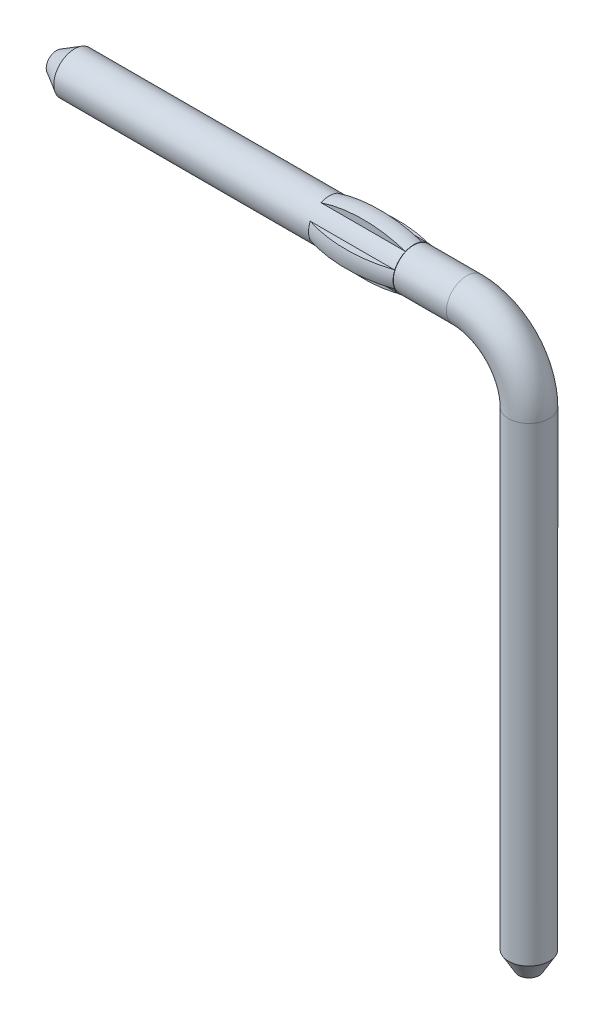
ISO-10303-21;
HEADER;
FILE_DESCRIPTION(('STEP AP214'),'2;1');
FILE_NAME('part.step','',(''),(''),'','','');
FILE_SCHEMA(('AUTOMOTIVE_DESIGN { 1 0 10303 214 1 1 1 1 }'));
ENDSEC;
DATA;
#1=APPLICATION_CONTEXT('core data for automotive mechanical design processes');
#2=APPLICATION_PROTOCOL_DEFINITION('international standard','automotive_design',2000,#1);
#3=PRODUCT_CONTEXT('',#1,'mechanical');
#4=PRODUCT('Part','Part','',(#3));
#5=PRODUCT_RELATED_PRODUCT_CATEGORY('part','',(#4));
#6=PRODUCT_DEFINITION_FORMATION('','',#4);
#7=PRODUCT_DEFINITION_CONTEXT('part definition',#1,'design');
#8=PRODUCT_DEFINITION('design','',#6,#7);
#9=PRODUCT_DEFINITION_SHAPE('','',#8);
#10=(LENGTH_UNIT() NAMED_UNIT(*) SI_UNIT(.MILLI.,.METRE.));
#11=(NAMED_UNIT(*) PLANE_ANGLE_UNIT() SI_UNIT($,.RADIAN.));
#12=(NAMED_UNIT(*) SI_UNIT($,.STERADIAN.) SOLID_ANGLE_UNIT());
#13=UNCERTAINTY_MEASURE_WITH_UNIT(LENGTH_MEASURE(1.E-05),#10,'distance_accuracy_value','');
#14=(GEOMETRIC_REPRESENTATION_CONTEXT(3) GLOBAL_UNCERTAINTY_ASSIGNED_CONTEXT((#13)) GLOBAL_UNIT_ASSIGNED_CONTEXT((#10,
#11,#12)) REPRESENTATION_CONTEXT('',''));
#15=CARTESIAN_POINT('',(0.,0.,0.));
#16=DIRECTION('',(0.,0.,1.));
#17=DIRECTION('',(1.,0.,0.));
#18=AXIS2_PLACEMENT_3D('',#15,#16,#17);
#19=CARTESIAN_POINT('',(-5.7,0.,0.));
#20=DIRECTION('',(1.,0.,0.));
#21=DIRECTION('',(0.,0.,-1.));
#22=AXIS2_PLACEMENT_3D('',#19,#20,#21);
#23=PLANE('',#22);
#24=CARTESIAN_POINT('',(-5.69999999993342,0.,0.));
#25=DIRECTION('',(1.,0.,0.));
#26=DIRECTION('',(0.,0.,-1.));
#27=AXIS2_PLACEMENT_3D('',#24,#25,#26);
#28=CIRCLE('',#27,0.12499999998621);
#29=CARTESIAN_POINT('',(-5.69999999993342,0.,-0.12499999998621));
#30=VERTEX_POINT('',#29);
#31=EDGE_CURVE('E21',#30,#30,#28,.T.);
#32=ORIENTED_EDGE('',*,*,#31,.F.);
#33=EDGE_LOOP('',(#32));
#34=FACE_BOUND('',#33,.T.);
#35=ADVANCED_FACE('F16',(#34),#23,.F.);
#36=CARTESIAN_POINT('',(-5.7,0.1,0.2291287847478));
#37=DIRECTION('',(0.,-1.,0.));
#38=DIRECTION('',(0.,0.,-1.));
#39=AXIS2_PLACEMENT_3D('',#36,#37,#38);
#40=PLANE('',#39);
#41=CARTESIAN_POINT('',(-1.39000000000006,0.1,0.229128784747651));
#42=CARTESIAN_POINT('',(-1.42100227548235,0.1,0.239288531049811));
#43=CARTESIAN_POINT('',(-1.45232127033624,0.1,0.248453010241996));
#44=CARTESIAN_POINT('',(-1.51545487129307,0.1,0.264830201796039));
#45=CARTESIAN_POINT('',(-1.54726930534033,0.1,0.272043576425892));
#46=CARTESIAN_POINT('',(-1.6435182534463,0.1,0.290870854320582));
#47=CARTESIAN_POINT('',(-1.7085269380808,0.1,0.299597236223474));
#48=CARTESIAN_POINT('',(-1.86808650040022,0.1,0.311579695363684));
#49=CARTESIAN_POINT('',(-1.96298668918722,0.1,0.310709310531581));
#50=CARTESIAN_POINT('',(-2.10398407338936,0.1,0.297494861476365));
#51=CARTESIAN_POINT('',(-2.15072624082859,0.1,0.29111365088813));
#52=CARTESIAN_POINT('',(-2.24348691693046,0.1,0.274376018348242));
#53=CARTESIAN_POINT('',(-2.28950587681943,0.1,0.264022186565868));
#54=CARTESIAN_POINT('',(-2.3601591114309,0.1,0.244758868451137));
#55=CARTESIAN_POINT('',(-2.385185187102,0.1,0.237261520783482));
#56=CARTESIAN_POINT('',(-2.41000000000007,0.1,0.22912878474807));
#57=B_SPLINE_CURVE_WITH_KNOTS('',3,(#41,#42,#43,#44,#45,#46,#47,#48,#49,#50,#51,#52,#53,#54,#55,
#56),.UNSPECIFIED.,.F.,.F.,(4,2,2,2,2,2,2,4),(0.,0.0978417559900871,0.19565025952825,
0.391991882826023,0.675172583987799,0.816569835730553,0.957875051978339,1.03621668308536),.UNSPECIFIED.);
#58=CARTESIAN_POINT('',(-1.39,0.0999999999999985,0.229128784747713));
#59=VERTEX_POINT('',#58);
#60=CARTESIAN_POINT('',(-2.40999999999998,0.0999999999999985,0.229128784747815));
#61=VERTEX_POINT('',#60);
#62=EDGE_CURVE('E118',#59,#61,#57,.T.);
#63=ORIENTED_EDGE('',*,*,#62,.F.);
#64=DIRECTION('',(1.,0.,0.));
#65=VECTOR('',#64,1.);
#66=CARTESIAN_POINT('',(-5.7,0.099999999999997,0.229128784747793));
#67=LINE('',#66,#65);
#68=EDGE_CURVE('E91',#61,#59,#67,.T.);
#69=ORIENTED_EDGE('',*,*,#68,.F.);
#70=EDGE_LOOP('',(#63,#69));
#71=FACE_BOUND('',#70,.T.);
#72=ADVANCED_FACE('F129',(#71),#40,.F.);
#73=CARTESIAN_POINT('',(-5.7,-0.1,0.2291287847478));
#74=DIRECTION('',(0.,-1.,0.));
#75=DIRECTION('',(0.,0.,-1.));
#76=AXIS2_PLACEMENT_3D('',#73,#74,#75);
#77=PLANE('',#76);
#78=DIRECTION('',(1.,0.,0.));
#79=VECTOR('',#78,1.);
#80=CARTESIAN_POINT('',(-5.7,-0.099999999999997,0.229128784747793));
#81=LINE('',#80,#79);
#82=CARTESIAN_POINT('',(-1.39,-0.0999999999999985,0.229128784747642));
#83=VERTEX_POINT('',#82);
#84=CARTESIAN_POINT('',(-2.40999999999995,-0.0999999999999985,0.229128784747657));
#85=VERTEX_POINT('',#84);
#86=EDGE_CURVE('E84',#83,#85,#81,.F.);
#87=ORIENTED_EDGE('',*,*,#86,.F.);
#88=CARTESIAN_POINT('',(-2.40999999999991,-0.1,0.22912878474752));
#89=CARTESIAN_POINT('',(-2.37899772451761,-0.1,0.239288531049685));
#90=CARTESIAN_POINT('',(-2.34767872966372,-0.1,0.248453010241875));
#91=CARTESIAN_POINT('',(-2.28454512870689,-0.1,0.264830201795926));
#92=CARTESIAN_POINT('',(-2.25273069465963,-0.1,0.272043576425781));
#93=CARTESIAN_POINT('',(-2.15648174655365,-0.1,0.290870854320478));
#94=CARTESIAN_POINT('',(-2.09147306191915,-0.1,0.299597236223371));
#95=CARTESIAN_POINT('',(-1.93191349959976,-0.1,0.311579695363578));
#96=CARTESIAN_POINT('',(-1.8370133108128,-0.1,0.310709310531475));
#97=CARTESIAN_POINT('',(-1.6960159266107,-0.1,0.297494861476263));
#98=CARTESIAN_POINT('',(-1.6492737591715,-0.1,0.29111365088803));
#99=CARTESIAN_POINT('',(-1.55651308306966,-0.1,0.274376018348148));
#100=CARTESIAN_POINT('',(-1.51049412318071,-0.1,0.264022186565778));
#101=CARTESIAN_POINT('',(-1.43984088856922,-0.1,0.244758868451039));
#102=CARTESIAN_POINT('',(-1.41481481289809,-0.1,0.237261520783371));
#103=CARTESIAN_POINT('',(-1.38999999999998,-0.1,0.229128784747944));
#104=B_SPLINE_CURVE_WITH_KNOTS('',3,(#88,#89,#90,#91,#92,#93,#94,#95,#96,#97,#98,#99,#100,#101,
#102,#103),.UNSPECIFIED.,.F.,.F.,(4,2,2,2,2,2,2,4),(0.,0.097841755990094,0.195650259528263,
0.391991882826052,0.675172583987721,0.816569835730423,0.957875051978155,1.03621668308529),.UNSPECIFIED.);
#105=EDGE_CURVE('E87',#85,#83,#104,.T.);
#106=ORIENTED_EDGE('',*,*,#105,.F.);
#107=EDGE_LOOP('',(#87,#106));
#108=FACE_BOUND('',#107,.T.);
#109=ADVANCED_FACE('F85',(#108),#77,.T.);
#110=CARTESIAN_POINT('',(-5.7,-0.3092329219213,0.1));
#111=DIRECTION('',(0.,0.,1.));
#112=DIRECTION('',(1.,0.,0.));
#113=AXIS2_PLACEMENT_3D('',#110,#111,#112);
#114=PLANE('',#113);
#115=DIRECTION('',(1.,0.,0.));
#116=VECTOR('',#115,1.);
#117=CARTESIAN_POINT('',(-5.7,-0.229128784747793,0.0999999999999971));
#118=LINE('',#117,#116);
#119=CARTESIAN_POINT('',(-2.40999999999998,-0.229128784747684,0.0999999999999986));
#120=VERTEX_POINT('',#119);
#121=CARTESIAN_POINT('',(-1.39,-0.229128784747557,0.0999999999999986));
#122=VERTEX_POINT('',#121);
#123=EDGE_CURVE('E113',#120,#122,#118,.T.);
#124=ORIENTED_EDGE('',*,*,#123,.F.);
#125=CARTESIAN_POINT('',(-1.39000000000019,-0.229128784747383,0.1));
#126=CARTESIAN_POINT('',(-1.4210022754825,-0.239288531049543,0.1));
#127=CARTESIAN_POINT('',(-1.45232127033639,-0.248453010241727,0.1));
#128=CARTESIAN_POINT('',(-1.51545487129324,-0.264830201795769,0.1));
#129=CARTESIAN_POINT('',(-1.5472693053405,-0.272043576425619,0.1));
#130=CARTESIAN_POINT('',(-1.6435182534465,-0.290870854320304,0.1));
#131=CARTESIAN_POINT('',(-1.70852693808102,-0.29959723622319,0.1));
#132=CARTESIAN_POINT('',(-1.86808650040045,-0.31157969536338,0.1));
#133=CARTESIAN_POINT('',(-1.96298668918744,-0.310709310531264,0.1));
#134=CARTESIAN_POINT('',(-2.10398407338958,-0.29749486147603,0.1));
#135=CARTESIAN_POINT('',(-2.1507262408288,-0.291113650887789,0.1));
#136=CARTESIAN_POINT('',(-2.24348691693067,-0.274376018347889,0.1));
#137=CARTESIAN_POINT('',(-2.28950587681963,-0.264022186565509,0.1));
#138=CARTESIAN_POINT('',(-2.360159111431,-0.244758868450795,0.1));
#139=CARTESIAN_POINT('',(-2.385185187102,-0.237261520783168,0.1));
#140=CARTESIAN_POINT('',(-2.40999999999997,-0.229128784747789,0.1));
#141=B_SPLINE_CURVE_WITH_KNOTS('',3,(#125,#126,#127,#128,#129,#130,#131,#132,#133,#134,#135,
#136,#137,#138,#139,#140),.UNSPECIFIED.,.F.,.F.,(4,2,2,2,2,2,2,4),(0.,0.0978417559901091,
0.195650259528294,0.391991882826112,0.675172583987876,0.816569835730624,0.957875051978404,
1.03621668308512),.UNSPECIFIED.);
#142=EDGE_CURVE('E107',#122,#120,#141,.T.);
#143=ORIENTED_EDGE('',*,*,#142,.F.);
#144=EDGE_LOOP('',(#124,#143));
#145=FACE_BOUND('',#144,.T.);
#146=ADVANCED_FACE('F156',(#145),#114,.T.);
#147=CARTESIAN_POINT('',(-5.7,-0.3092329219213,-0.1));
#148=DIRECTION('',(0.,0.,1.));
#149=DIRECTION('',(1.,0.,0.));
#150=AXIS2_PLACEMENT_3D('',#147,#148,#149);
#151=PLANE('',#150);
#152=CARTESIAN_POINT('',(-2.40999999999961,-0.229128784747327,-0.1));
#153=CARTESIAN_POINT('',(-2.3789977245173,-0.23928853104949,-0.1));
#154=CARTESIAN_POINT('',(-2.34767872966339,-0.248453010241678,-0.1));
#155=CARTESIAN_POINT('',(-2.28454512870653,-0.264830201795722,-0.1));
#156=CARTESIAN_POINT('',(-2.25273069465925,-0.272043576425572,-0.1));
#157=CARTESIAN_POINT('',(-2.15648174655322,-0.290870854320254,-0.1));
#158=CARTESIAN_POINT('',(-2.09147306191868,-0.299597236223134,-0.1));
#159=CARTESIAN_POINT('',(-1.93191349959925,-0.311579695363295,-0.1));
#160=CARTESIAN_POINT('',(-1.83701331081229,-0.310709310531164,-0.1));
#161=CARTESIAN_POINT('',(-1.6960159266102,-0.29749486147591,-0.1));
#162=CARTESIAN_POINT('',(-1.649273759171,-0.291113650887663,-0.1));
#163=CARTESIAN_POINT('',(-1.55651308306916,-0.274376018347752,-0.1));
#164=CARTESIAN_POINT('',(-1.51049412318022,-0.264022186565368,-0.1));
#165=CARTESIAN_POINT('',(-1.43984088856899,-0.244758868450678,-0.1));
#166=CARTESIAN_POINT('',(-1.41481481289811,-0.237261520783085,-0.1));
#167=CARTESIAN_POINT('',(-1.39000000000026,-0.229128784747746,-0.1));
#168=B_SPLINE_CURVE_WITH_KNOTS('',3,(#152,#153,#154,#155,#156,#157,#158,#159,#160,#161,#162,
#163,#164,#165,#166,#167),.UNSPECIFIED.,.F.,.F.,(4,2,2,2,2,2,2,4),(0.,0.0978417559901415,
0.195650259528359,0.391991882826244,0.675172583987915,0.816569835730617,0.957875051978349,
1.03621668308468),.UNSPECIFIED.);
#169=CARTESIAN_POINT('',(-2.40999999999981,-0.22912878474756,-0.0999999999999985));
#170=VERTEX_POINT('',#169);
#171=CARTESIAN_POINT('',(-1.39000000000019,-0.229128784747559,-0.0999999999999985));
#172=VERTEX_POINT('',#171);
#173=EDGE_CURVE('E145',#170,#172,#168,.T.);
#174=ORIENTED_EDGE('',*,*,#173,.F.);
#175=DIRECTION('',(1.,0.,0.));
#176=VECTOR('',#175,1.);
#177=CARTESIAN_POINT('',(-5.7,-0.229128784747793,-0.0999999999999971));
#178=LINE('',#177,#176);
#179=EDGE_CURVE('E216',#172,#170,#178,.F.);
#180=ORIENTED_EDGE('',*,*,#179,.F.);
#181=EDGE_LOOP('',(#174,#180));
#182=FACE_BOUND('',#181,.T.);
#183=ADVANCED_FACE('F159',(#182),#151,.F.);
#184=CARTESIAN_POINT('',(-5.48349364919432,0.,0.));
#185=DIRECTION('',(1.,0.,0.));
#186=DIRECTION('',(0.,0.,-1.));
#187=AXIS2_PLACEMENT_3D('',#184,#185,#186);
#188=CONICAL_SURFACE('',#187,0.249999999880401,0.523598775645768);
#189=CARTESIAN_POINT('',(-5.483493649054,0.,0.));
#190=DIRECTION('',(1.,0.,0.));
#191=DIRECTION('',(0.,0.,-1.));
#192=AXIS2_PLACEMENT_3D('',#189,#190,#191);
#193=CIRCLE('',#192,0.25);
#194=CARTESIAN_POINT('',(-5.483493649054,0.,-0.25));
#195=VERTEX_POINT('',#194);
#196=EDGE_CURVE('E210',#195,#195,#193,.T.);
#197=ORIENTED_EDGE('',*,*,#196,.F.);
#198=EDGE_LOOP('',(#197));
#199=FACE_BOUND('',#198,.T.);
#200=ORIENTED_EDGE('',*,*,#31,.T.);
#201=EDGE_LOOP('',(#200));
#202=FACE_BOUND('',#201,.T.);
#203=ADVANCED_FACE('F296',(#199,#202),#188,.T.);
#204=CARTESIAN_POINT('',(-5.7,0.1,-0.2291287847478));
#205=DIRECTION('',(0.,1.,0.));
#206=DIRECTION('',(0.,0.,1.));
#207=AXIS2_PLACEMENT_3D('',#204,#205,#206);
#208=PLANE('',#207);
#209=DIRECTION('',(1.,0.,0.));
#210=VECTOR('',#209,1.);
#211=CARTESIAN_POINT('',(-5.7,0.0999999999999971,-0.229128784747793));
#212=LINE('',#211,#210);
#213=CARTESIAN_POINT('',(-1.39000000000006,0.0999999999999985,-0.229128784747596));
#214=VERTEX_POINT('',#213);
#215=CARTESIAN_POINT('',(-2.40999999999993,0.0999999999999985,-0.229128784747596));
#216=VERTEX_POINT('',#215);
#217=EDGE_CURVE('E209',#214,#216,#212,.F.);
#218=ORIENTED_EDGE('',*,*,#217,.F.);
#219=CARTESIAN_POINT('',(-2.40999999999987,0.1,-0.229128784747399));
#220=CARTESIAN_POINT('',(-2.37899772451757,0.1,-0.239288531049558));
#221=CARTESIAN_POINT('',(-2.34767872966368,0.1,-0.248453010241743));
#222=CARTESIAN_POINT('',(-2.28454512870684,0.1,-0.264830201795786));
#223=CARTESIAN_POINT('',(-2.25273069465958,0.1,-0.272043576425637));
#224=CARTESIAN_POINT('',(-2.15648174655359,0.1,-0.290870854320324));
#225=CARTESIAN_POINT('',(-2.09147306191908,0.1,-0.299597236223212));
#226=CARTESIAN_POINT('',(-1.93191349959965,0.1,-0.311579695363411));
#227=CARTESIAN_POINT('',(-1.83701331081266,0.1,-0.310709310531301));
#228=CARTESIAN_POINT('',(-1.69601592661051,0.1,-0.297494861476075));
#229=CARTESIAN_POINT('',(-1.64927375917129,0.1,-0.291113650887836));
#230=CARTESIAN_POINT('',(-1.55651308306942,0.1,-0.274376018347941));
#231=CARTESIAN_POINT('',(-1.51049412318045,0.1,-0.264022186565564));
#232=CARTESIAN_POINT('',(-1.43984088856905,0.1,-0.244758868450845));
#233=CARTESIAN_POINT('',(-1.41481481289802,0.1,-0.23726152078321));
#234=CARTESIAN_POINT('',(-1.39000000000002,0.1,-0.229128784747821));
#235=B_SPLINE_CURVE_WITH_KNOTS('',3,(#219,#220,#221,#222,#223,#224,#225,#226,#227,#228,#229,
#230,#231,#232,#233,#234),.UNSPECIFIED.,.F.,.F.,(4,2,2,2,2,2,2,4),(0.,0.097841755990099,
0.195650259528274,0.391991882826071,0.675172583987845,0.816569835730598,0.957875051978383,
1.0362166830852),.UNSPECIFIED.);
#236=EDGE_CURVE('E220',#216,#214,#235,.T.);
#237=ORIENTED_EDGE('',*,*,#236,.F.);
#238=EDGE_LOOP('',(#218,#237));
#239=FACE_BOUND('',#238,.T.);
#240=ADVANCED_FACE('F271',(#239),#208,.T.);
#241=CARTESIAN_POINT('',(-5.7,-0.1,-0.2291287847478));
#242=DIRECTION('',(0.,1.,0.));
#243=DIRECTION('',(0.,0.,1.));
#244=AXIS2_PLACEMENT_3D('',#241,#242,#243);
#245=PLANE('',#244);
#246=CARTESIAN_POINT('',(-1.3900000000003,-0.1,-0.229128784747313));
#247=CARTESIAN_POINT('',(-1.42100227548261,-0.1,-0.239288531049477));
#248=CARTESIAN_POINT('',(-1.45232127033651,-0.1,-0.248453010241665));
#249=CARTESIAN_POINT('',(-1.51545487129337,-0.1,-0.264830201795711));
#250=CARTESIAN_POINT('',(-1.54726930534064,-0.1,-0.272043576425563));
#251=CARTESIAN_POINT('',(-1.64351825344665,-0.1,-0.29087085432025));
#252=CARTESIAN_POINT('',(-1.70852693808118,-0.1,-0.299597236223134));
#253=CARTESIAN_POINT('',(-1.8680865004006,-0.1,-0.311579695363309));
#254=CARTESIAN_POINT('',(-1.96298668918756,-0.1,-0.310709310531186));
#255=CARTESIAN_POINT('',(-2.10398407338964,-0.1,-0.297494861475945));
#256=CARTESIAN_POINT('',(-2.15072624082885,-0.1,-0.291113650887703));
#257=CARTESIAN_POINT('',(-2.24348691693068,-0.1,-0.274376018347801));
#258=CARTESIAN_POINT('',(-2.28950587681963,-0.1,-0.264022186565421));
#259=CARTESIAN_POINT('',(-2.36015911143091,-0.1,-0.244758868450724));
#260=CARTESIAN_POINT('',(-2.38518518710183,-0.1,-0.237261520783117));
#261=CARTESIAN_POINT('',(-2.40999999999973,-0.1,-0.229128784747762));
#262=B_SPLINE_CURVE_WITH_KNOTS('',3,(#246,#247,#248,#249,#250,#251,#252,#253,#254,#255,#256,
#257,#258,#259,#260,#261),.UNSPECIFIED.,.F.,.F.,(4,2,2,2,2,2,2,4),(0.,0.0978417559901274,
0.19565025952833,0.391991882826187,0.675172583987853,0.816569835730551,0.957875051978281,
1.03621668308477),.UNSPECIFIED.);
#263=CARTESIAN_POINT('',(-1.39000000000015,-0.0999999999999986,-0.229128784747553));
#264=VERTEX_POINT('',#263);
#265=CARTESIAN_POINT('',(-2.40999999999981,-0.0999999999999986,-0.229128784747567));
#266=VERTEX_POINT('',#265);
#267=EDGE_CURVE('E274',#264,#266,#262,.T.);
#268=ORIENTED_EDGE('',*,*,#267,.F.);
#269=DIRECTION('',(1.,0.,0.));
#270=VECTOR('',#269,1.);
#271=CARTESIAN_POINT('',(-5.7,-0.0999999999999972,-0.229128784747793));
#272=LINE('',#271,#270);
#273=EDGE_CURVE('E214',#266,#264,#272,.T.);
#274=ORIENTED_EDGE('',*,*,#273,.F.);
#275=EDGE_LOOP('',(#268,#274));
#276=FACE_BOUND('',#275,.T.);
#277=ADVANCED_FACE('F267',(#276),#245,.F.);
#278=CARTESIAN_POINT('',(-5.7,0.3092329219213,-0.1));
#279=DIRECTION('',(0.,0.,-1.));
#280=DIRECTION('',(-1.,0.,0.));
#281=AXIS2_PLACEMENT_3D('',#278,#279,#280);
#282=PLANE('',#281);
#283=DIRECTION('',(1.,0.,0.));
#284=VECTOR('',#283,1.);
#285=CARTESIAN_POINT('',(-5.7,0.229128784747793,-0.0999999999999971));
#286=LINE('',#285,#284);
#287=CARTESIAN_POINT('',(-2.40999999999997,0.229128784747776,-0.0999999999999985));
#288=VERTEX_POINT('',#287);
#289=CARTESIAN_POINT('',(-1.39000000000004,0.229128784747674,-0.0999999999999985));
#290=VERTEX_POINT('',#289);
#291=EDGE_CURVE('E207',#288,#290,#286,.T.);
#292=ORIENTED_EDGE('',*,*,#291,.F.);
#293=CARTESIAN_POINT('',(-1.39000000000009,0.229128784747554,-0.1));
#294=CARTESIAN_POINT('',(-1.42100227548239,0.239288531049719,-0.1));
#295=CARTESIAN_POINT('',(-1.45232127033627,0.248453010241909,-0.1));
#296=CARTESIAN_POINT('',(-1.51545487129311,0.264830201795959,-0.1));
#297=CARTESIAN_POINT('',(-1.54726930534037,0.272043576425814,-0.1));
#298=CARTESIAN_POINT('',(-1.64351825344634,0.290870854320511,-0.1));
#299=CARTESIAN_POINT('',(-1.70852693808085,0.299597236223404,-0.1));
#300=CARTESIAN_POINT('',(-1.86808650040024,0.311579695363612,-0.1));
#301=CARTESIAN_POINT('',(-1.9629866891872,0.310709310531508,-0.1));
#302=CARTESIAN_POINT('',(-2.1039840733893,0.297494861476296,-0.1));
#303=CARTESIAN_POINT('',(-2.15072624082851,0.291113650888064,-0.1));
#304=CARTESIAN_POINT('',(-2.24348691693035,0.274376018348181,-0.1));
#305=CARTESIAN_POINT('',(-2.2895058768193,0.26402218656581,-0.1));
#306=CARTESIAN_POINT('',(-2.3601591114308,0.244758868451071,-0.1));
#307=CARTESIAN_POINT('',(-2.38518518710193,0.237261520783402,-0.1));
#308=CARTESIAN_POINT('',(-2.41000000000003,0.229128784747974,-0.1));
#309=B_SPLINE_CURVE_WITH_KNOTS('',3,(#293,#294,#295,#296,#297,#298,#299,#300,#301,#302,#303,
#304,#305,#306,#307,#308),.UNSPECIFIED.,.F.,.F.,(4,2,2,2,2,2,2,4),(0.,0.0978417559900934,
0.195650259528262,0.391991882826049,0.675172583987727,0.816569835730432,0.957875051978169,
1.03621668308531),.UNSPECIFIED.);
#310=EDGE_CURVE('E35',#290,#288,#309,.T.);
#311=ORIENTED_EDGE('',*,*,#310,.F.);
#312=EDGE_LOOP('',(#292,#311));
#313=FACE_BOUND('',#312,.T.);
#314=ADVANCED_FACE('F262',(#313),#282,.T.);
#315=CARTESIAN_POINT('',(-5.7,0.3092329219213,0.1));
#316=DIRECTION('',(0.,0.,-1.));
#317=DIRECTION('',(-1.,0.,0.));
#318=AXIS2_PLACEMENT_3D('',#315,#316,#317);
#319=PLANE('',#318);
#320=CARTESIAN_POINT('',(-2.40999999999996,0.229128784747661,0.1));
#321=CARTESIAN_POINT('',(-2.37899772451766,0.239288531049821,0.1));
#322=CARTESIAN_POINT('',(-2.34767872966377,0.248453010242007,0.1));
#323=CARTESIAN_POINT('',(-2.28454512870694,0.264830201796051,0.1));
#324=CARTESIAN_POINT('',(-2.25273069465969,0.272043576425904,0.1));
#325=CARTESIAN_POINT('',(-2.15648174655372,0.290870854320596,0.1));
#326=CARTESIAN_POINT('',(-2.09147306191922,0.299597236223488,0.1));
#327=CARTESIAN_POINT('',(-1.9319134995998,0.311579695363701,0.1));
#328=CARTESIAN_POINT('',(-1.83701331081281,0.310709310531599,0.1));
#329=CARTESIAN_POINT('',(-1.69601592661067,0.297494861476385,0.1));
#330=CARTESIAN_POINT('',(-1.64927375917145,0.291113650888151,0.1));
#331=CARTESIAN_POINT('',(-1.55651308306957,0.274376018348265,0.1));
#332=CARTESIAN_POINT('',(-1.51049412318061,0.264022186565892,0.1));
#333=CARTESIAN_POINT('',(-1.43984088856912,0.244758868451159,0.1));
#334=CARTESIAN_POINT('',(-1.41481481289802,0.237261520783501,0.1));
#335=CARTESIAN_POINT('',(-1.38999999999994,0.229128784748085,0.1));
#336=B_SPLINE_CURVE_WITH_KNOTS('',3,(#320,#321,#322,#323,#324,#325,#326,#327,#328,#329,#330,
#331,#332,#333,#334,#335),.UNSPECIFIED.,.F.,.F.,(4,2,2,2,2,2,2,4),(0.,0.0978417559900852,
0.195650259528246,0.391991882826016,0.675172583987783,0.816569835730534,0.957875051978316,
1.03621668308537),.UNSPECIFIED.);
#337=CARTESIAN_POINT('',(-2.41,0.229128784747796,0.1));
#338=VERTEX_POINT('',#337);
#339=CARTESIAN_POINT('',(-1.39000000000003,0.229128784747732,0.1));
#340=VERTEX_POINT('',#339);
#341=EDGE_CURVE('E103',#338,#340,#336,.T.);
#342=ORIENTED_EDGE('',*,*,#341,.F.);
#343=DIRECTION('',(-1.,0.,0.));
#344=VECTOR('',#343,1.);
#345=CARTESIAN_POINT('',(-5.7,0.2291287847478,0.1));
#346=LINE('',#345,#344);
#347=EDGE_CURVE('E117',#340,#338,#346,.T.);
#348=ORIENTED_EDGE('',*,*,#347,.F.);
#349=EDGE_LOOP('',(#342,#348));
#350=FACE_BOUND('',#349,.T.);
#351=ADVANCED_FACE('F136',(#350),#319,.F.);
#352=CARTESIAN_POINT('',(-1.9,1.62847166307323E-13,1.37693675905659E-13));
#353=DIRECTION('',(1.,0.,0.));
#354=DIRECTION('',(0.,0.,-1.));
#355=AXIS2_PLACEMENT_3D('',#352,#353,#354);
#356=DEGENERATE_TOROIDAL_SURFACE('',#355,1.44649999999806,1.77149999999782,.F.);
#357=ORIENTED_EDGE('',*,*,#105,.T.);
#358=CARTESIAN_POINT('',(-1.39,1.62847166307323E-13,1.37693675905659E-13));
#359=DIRECTION('',(1.,0.,0.));
#360=DIRECTION('',(0.,0.,-1.));
#361=AXIS2_PLACEMENT_3D('',#358,#359,#360);
#362=CIRCLE('',#361,0.249999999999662);
#363=EDGE_CURVE('E94',#59,#83,#362,.T.);
#364=ORIENTED_EDGE('',*,*,#363,.F.);
#365=ORIENTED_EDGE('',*,*,#62,.T.);
#366=CARTESIAN_POINT('',(-2.40999999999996,1.39401294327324E-13,1.10588621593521E-13));
#367=DIRECTION('',(1.,0.,0.));
#368=DIRECTION('',(0.,1.,0.));
#369=AXIS2_PLACEMENT_3D('',#366,#367,#368);
#370=CIRCLE('',#369,0.249999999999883);
#371=EDGE_CURVE('E106',#61,#85,#370,.T.);
#372=ORIENTED_EDGE('',*,*,#371,.T.);
#373=EDGE_LOOP('',(#357,#364,#365,#372));
#374=FACE_BOUND('',#373,.T.);
#375=ADVANCED_FACE('F105',(#374),#356,.F.);
#376=CARTESIAN_POINT('',(-1.9,1.62847166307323E-13,1.37693675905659E-13));
#377=DIRECTION('',(1.,0.,0.));
#378=DIRECTION('',(0.,0.,-1.));
#379=AXIS2_PLACEMENT_3D('',#376,#377,#378);
#380=DEGENERATE_TOROIDAL_SURFACE('',#379,1.44649999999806,1.77149999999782,.F.);
#381=ORIENTED_EDGE('',*,*,#173,.T.);
#382=CARTESIAN_POINT('',(-1.39,1.62847166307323E-13,1.37693675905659E-13));
#383=DIRECTION('',(1.,0.,0.));
#384=DIRECTION('',(0.,0.,-1.));
#385=AXIS2_PLACEMENT_3D('',#382,#383,#384);
#386=CIRCLE('',#385,0.249999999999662);
#387=EDGE_CURVE('E102',#122,#172,#386,.T.);
#388=ORIENTED_EDGE('',*,*,#387,.F.);
#389=ORIENTED_EDGE('',*,*,#142,.T.);
#390=CARTESIAN_POINT('',(-2.41,0.,0.));
#391=DIRECTION('',(1.,0.,0.));
#392=DIRECTION('',(0.,0.,-1.));
#393=AXIS2_PLACEMENT_3D('',#390,#391,#392);
#394=CIRCLE('',#393,0.25);
#395=EDGE_CURVE('E219',#170,#120,#394,.F.);
#396=ORIENTED_EDGE('',*,*,#395,.F.);
#397=EDGE_LOOP('',(#381,#388,#389,#396));
#398=FACE_BOUND('',#397,.T.);
#399=ADVANCED_FACE('F135',(#398),#380,.F.);
#400=CARTESIAN_POINT('',(-1.9,1.62847166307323E-13,1.37693675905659E-13));
#401=DIRECTION('',(1.,0.,0.));
#402=DIRECTION('',(0.,0.,-1.));
#403=AXIS2_PLACEMENT_3D('',#400,#401,#402);
#404=DEGENERATE_TOROIDAL_SURFACE('',#403,1.44649999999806,1.77149999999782,.F.);
#405=ORIENTED_EDGE('',*,*,#236,.T.);
#406=CARTESIAN_POINT('',(-1.39000000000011,1.62847166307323E-13,1.37693675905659E-13));
#407=DIRECTION('',(1.,0.,0.));
#408=DIRECTION('',(0.,0.,-1.));
#409=AXIS2_PLACEMENT_3D('',#406,#407,#408);
#410=CIRCLE('',#409,0.249999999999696);
#411=EDGE_CURVE('E241',#264,#214,#410,.T.);
#412=ORIENTED_EDGE('',*,*,#411,.F.);
#413=ORIENTED_EDGE('',*,*,#267,.T.);
#414=CARTESIAN_POINT('',(-2.41,0.,0.));
#415=DIRECTION('',(1.,0.,0.));
#416=DIRECTION('',(0.,0.,-1.));
#417=AXIS2_PLACEMENT_3D('',#414,#415,#416);
#418=CIRCLE('',#417,0.25);
#419=EDGE_CURVE('E213',#216,#266,#418,.F.);
#420=ORIENTED_EDGE('',*,*,#419,.F.);
#421=EDGE_LOOP('',(#405,#412,#413,#420));
#422=FACE_BOUND('',#421,.T.);
#423=ADVANCED_FACE('F140',(#422),#404,.F.);
#424=CARTESIAN_POINT('',(-5.7,0.,0.));
#425=DIRECTION('',(1.,0.,0.));
#426=DIRECTION('',(0.,0.,-1.));
#427=AXIS2_PLACEMENT_3D('',#424,#425,#426);
#428=CYLINDRICAL_SURFACE('',#427,0.25);
#429=ORIENTED_EDGE('',*,*,#196,.T.);
#430=EDGE_LOOP('',(#429));
#431=FACE_BOUND('',#430,.T.);
#432=ORIENTED_EDGE('',*,*,#273,.T.);
#433=CARTESIAN_POINT('',(-1.39,0.,0.));
#434=DIRECTION('',(1.,0.,0.));
#435=DIRECTION('',(0.,0.,-1.));
#436=AXIS2_PLACEMENT_3D('',#433,#434,#435);
#437=CIRCLE('',#436,0.25);
#438=EDGE_CURVE('E244',#172,#264,#437,.T.);
#439=ORIENTED_EDGE('',*,*,#438,.F.);
#440=ORIENTED_EDGE('',*,*,#179,.T.);
#441=ORIENTED_EDGE('',*,*,#395,.T.);
#442=ORIENTED_EDGE('',*,*,#123,.T.);
#443=CARTESIAN_POINT('',(-1.39,0.,0.));
#444=DIRECTION('',(1.,0.,0.));
#445=DIRECTION('',(0.,0.,-1.));
#446=AXIS2_PLACEMENT_3D('',#443,#444,#445);
#447=CIRCLE('',#446,0.25);
#448=EDGE_CURVE('E79',#122,#83,#447,.F.);
#449=ORIENTED_EDGE('',*,*,#448,.T.);
#450=ORIENTED_EDGE('',*,*,#86,.T.);
#451=ORIENTED_EDGE('',*,*,#371,.F.);
#452=ORIENTED_EDGE('',*,*,#68,.T.);
#453=CARTESIAN_POINT('',(-1.39,0.,0.));
#454=DIRECTION('',(1.,0.,0.));
#455=DIRECTION('',(0.,0.,-1.));
#456=AXIS2_PLACEMENT_3D('',#453,#454,#455);
#457=CIRCLE('',#456,0.25);
#458=EDGE_CURVE('E98',#59,#340,#457,.F.);
#459=ORIENTED_EDGE('',*,*,#458,.T.);
#460=ORIENTED_EDGE('',*,*,#347,.T.);
#461=CARTESIAN_POINT('',(-2.40999999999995,1.38791430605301E-13,1.09816127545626E-13));
#462=DIRECTION('',(1.,0.,0.));
#463=DIRECTION('',(0.,1.,0.));
#464=AXIS2_PLACEMENT_3D('',#461,#462,#463);
#465=CIRCLE('',#464,0.249999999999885);
#466=EDGE_CURVE('E202',#288,#338,#465,.T.);
#467=ORIENTED_EDGE('',*,*,#466,.F.);
#468=ORIENTED_EDGE('',*,*,#291,.T.);
#469=CARTESIAN_POINT('',(-1.39,0.,0.));
#470=DIRECTION('',(1.,0.,0.));
#471=DIRECTION('',(0.,0.,-1.));
#472=AXIS2_PLACEMENT_3D('',#469,#470,#471);
#473=CIRCLE('',#472,0.25);
#474=EDGE_CURVE('E239',#214,#290,#473,.T.);
#475=ORIENTED_EDGE('',*,*,#474,.F.);
#476=ORIENTED_EDGE('',*,*,#217,.T.);
#477=ORIENTED_EDGE('',*,*,#419,.T.);
#478=EDGE_LOOP('',(#432,#439,#440,#441,#442,#449,#450,#451,#452,#459,#460,#467,#468,#475,#476,#477));
#479=FACE_BOUND('',#478,.T.);
#480=ADVANCED_FACE('F111',(#431,#479),#428,.T.);
#481=CARTESIAN_POINT('',(-1.9,1.62847166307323E-13,1.37693675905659E-13));
#482=DIRECTION('',(1.,0.,0.));
#483=DIRECTION('',(0.,0.,-1.));
#484=AXIS2_PLACEMENT_3D('',#481,#482,#483);
#485=DEGENERATE_TOROIDAL_SURFACE('',#484,1.44649999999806,1.77149999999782,.F.);
#486=ORIENTED_EDGE('',*,*,#341,.T.);
#487=CARTESIAN_POINT('',(-1.39,1.62847166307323E-13,1.37693675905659E-13));
#488=DIRECTION('',(1.,0.,0.));
#489=DIRECTION('',(0.,0.,-1.));
#490=AXIS2_PLACEMENT_3D('',#487,#488,#489);
#491=CIRCLE('',#490,0.249999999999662);
#492=EDGE_CURVE('E237',#290,#340,#491,.T.);
#493=ORIENTED_EDGE('',*,*,#492,.F.);
#494=ORIENTED_EDGE('',*,*,#310,.T.);
#495=ORIENTED_EDGE('',*,*,#466,.T.);
#496=EDGE_LOOP('',(#486,#493,#494,#495));
#497=FACE_BOUND('',#496,.T.);
#498=ADVANCED_FACE('F18',(#497),#485,.F.);
#499=CARTESIAN_POINT('',(-1.39,0.,0.));
#500=DIRECTION('',(1.,0.,0.));
#501=DIRECTION('',(0.,0.,-1.));
#502=AXIS2_PLACEMENT_3D('',#499,#500,#501);
#503=PLANE('',#502);
#504=CARTESIAN_POINT('',(-1.39,0.,0.));
#505=DIRECTION('',(1.,0.,0.));
#506=DIRECTION('',(0.,0.,-1.));
#507=AXIS2_PLACEMENT_3D('',#504,#505,#506);
#508=CIRCLE('',#507,0.246);
#509=CARTESIAN_POINT('',(-1.39,0.,-0.246));
#510=VERTEX_POINT('',#509);
#511=EDGE_CURVE('E201',#510,#510,#508,.T.);
#512=ORIENTED_EDGE('',*,*,#511,.F.);
#513=EDGE_LOOP('',(#512));
#514=FACE_BOUND('',#513,.T.);
#515=ORIENTED_EDGE('',*,*,#474,.T.);
#516=ORIENTED_EDGE('',*,*,#492,.T.);
#517=ORIENTED_EDGE('',*,*,#458,.F.);
#518=ORIENTED_EDGE('',*,*,#363,.T.);
#519=ORIENTED_EDGE('',*,*,#448,.F.);
#520=ORIENTED_EDGE('',*,*,#387,.T.);
#521=ORIENTED_EDGE('',*,*,#438,.T.);
#522=ORIENTED_EDGE('',*,*,#411,.T.);
#523=EDGE_LOOP('',(#515,#516,#517,#518,#519,#520,#521,#522));
#524=FACE_BOUND('',#523,.T.);
#525=ADVANCED_FACE('F96',(#514,#524),#503,.T.);
#526=CARTESIAN_POINT('',(-1.39,0.,0.));
#527=DIRECTION('',(1.,0.,0.));
#528=DIRECTION('',(0.,0.,-1.));
#529=AXIS2_PLACEMENT_3D('',#526,#527,#528);
#530=CYLINDRICAL_SURFACE('',#529,0.246);
#531=CARTESIAN_POINT('',(-0.75,0.,0.));
#532=DIRECTION('',(1.,0.,0.));
#533=DIRECTION('',(0.,1.,0.));
#534=AXIS2_PLACEMENT_3D('',#531,#532,#533);
#535=CIRCLE('',#534,0.246);
#536=CARTESIAN_POINT('',(-0.75,0.246,0.));
#537=VERTEX_POINT('',#536);
#538=EDGE_CURVE('E197',#537,#537,#535,.T.);
#539=ORIENTED_EDGE('',*,*,#538,.F.);
#540=EDGE_LOOP('',(#539));
#541=FACE_BOUND('',#540,.T.);
#542=ORIENTED_EDGE('',*,*,#511,.T.);
#543=EDGE_LOOP('',(#542));
#544=FACE_BOUND('',#543,.T.);
#545=ADVANCED_FACE('F191',(#541,#544),#530,.T.);
#546=CARTESIAN_POINT('',(-0.75,-0.75,0.));
#547=DIRECTION('',(0.,0.,-1.));
#548=DIRECTION('',(0.,-1.,0.));
#549=AXIS2_PLACEMENT_3D('',#546,#547,#548);
#550=TOROIDAL_SURFACE('',#549,0.75,0.246);
#551=CARTESIAN_POINT('',(0.,-0.75,0.));
#552=DIRECTION('',(0.,-1.,0.));
#553=DIRECTION('',(0.,0.,-1.));
#554=AXIS2_PLACEMENT_3D('',#551,#552,#553);
#555=CIRCLE('',#554,0.246);
#556=CARTESIAN_POINT('',(0.,-0.75,-0.246));
#557=VERTEX_POINT('',#556);
#558=EDGE_CURVE('E200',#557,#557,#555,.T.);
#559=ORIENTED_EDGE('',*,*,#558,.F.);
#560=EDGE_LOOP('',(#559));
#561=FACE_BOUND('',#560,.T.);
#562=ORIENTED_EDGE('',*,*,#538,.T.);
#563=EDGE_LOOP('',(#562));
#564=FACE_BOUND('',#563,.T.);
#565=ADVANCED_FACE('F186',(#561,#564),#550,.T.);
#566=CARTESIAN_POINT('',(0.,-6.63,0.));
#567=DIRECTION('',(0.,-1.,0.));
#568=DIRECTION('',(0.,0.,-1.));
#569=AXIS2_PLACEMENT_3D('',#566,#567,#568);
#570=PLANE('',#569);
#571=CARTESIAN_POINT('',(0.,-6.62999999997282,0.));
#572=DIRECTION('',(0.,1.,0.));
#573=DIRECTION('',(0.,0.,1.));
#574=AXIS2_PLACEMENT_3D('',#571,#572,#573);
#575=CIRCLE('',#574,0.124999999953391);
#576=CARTESIAN_POINT('',(0.,-6.62999999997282,0.124999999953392));
#577=VERTEX_POINT('',#576);
#578=EDGE_CURVE('E27',#577,#577,#575,.T.);
#579=ORIENTED_EDGE('',*,*,#578,.F.);
#580=EDGE_LOOP('',(#579));
#581=FACE_BOUND('',#580,.T.);
#582=ADVANCED_FACE('F178',(#581),#570,.T.);
#583=CARTESIAN_POINT('',(0.,-6.42042185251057,0.));
#584=DIRECTION('',(0.,1.,0.));
#585=DIRECTION('',(0.,0.,1.));
#586=AXIS2_PLACEMENT_3D('',#583,#584,#585);
#587=CONICAL_SURFACE('',#586,0.245999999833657,0.523598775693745);
#588=ORIENTED_EDGE('',*,*,#578,.T.);
#589=EDGE_LOOP('',(#588));
#590=FACE_BOUND('',#589,.T.);
#591=CARTESIAN_POINT('',(0.,-6.420421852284,0.));
#592=DIRECTION('',(0.,-1.,0.));
#593=DIRECTION('',(0.,0.,-1.));
#594=AXIS2_PLACEMENT_3D('',#591,#592,#593);
#595=CIRCLE('',#594,0.246);
#596=CARTESIAN_POINT('',(0.,-6.420421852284,-0.246));
#597=VERTEX_POINT('',#596);
#598=EDGE_CURVE('E11',#597,#597,#595,.F.);
#599=ORIENTED_EDGE('',*,*,#598,.F.);
#600=EDGE_LOOP('',(#599));
#601=FACE_BOUND('',#600,.T.);
#602=ADVANCED_FACE('F172',(#590,#601),#587,.T.);
#603=CARTESIAN_POINT('',(0.,-0.75,0.));
#604=DIRECTION('',(0.,-1.,0.));
#605=DIRECTION('',(0.,0.,-1.));
#606=AXIS2_PLACEMENT_3D('',#603,#604,#605);
#607=CYLINDRICAL_SURFACE('',#606,0.246);
#608=ORIENTED_EDGE('',*,*,#558,.T.);
#609=EDGE_LOOP('',(#608));
#610=FACE_BOUND('',#609,.T.);
#611=ORIENTED_EDGE('',*,*,#598,.T.);
#612=EDGE_LOOP('',(#611));
#613=FACE_BOUND('',#612,.T.);
#614=ADVANCED_FACE('F170',(#610,#613),#607,.T.);
#615=CLOSED_SHELL('',(#35,#72,#109,#146,#183,#203,#240,#277,#314,#351,#375,#399,#423,#480,#498,
#525,#545,#565,#582,#602,#614));
#616=MANIFOLD_SOLID_BREP('B1',#615);
#617=ADVANCED_BREP_SHAPE_REPRESENTATION('',(#18,#616),#14);
#618=SHAPE_DEFINITION_REPRESENTATION(#9,#617);
ENDSEC;
END-ISO-10303-21;
